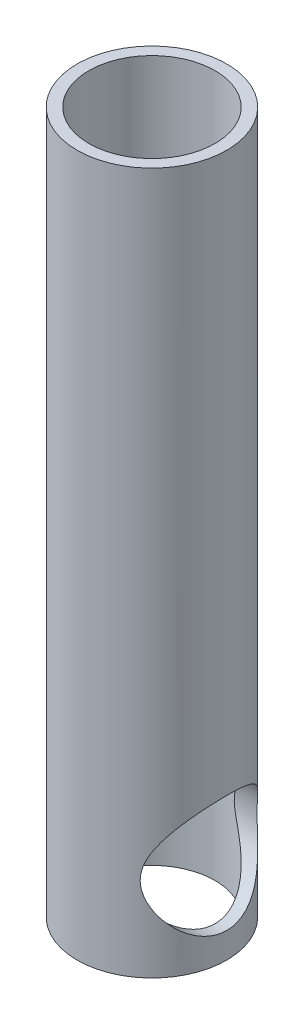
ISO-10303-21;
HEADER;
FILE_DESCRIPTION(('STEP AP214'),'2;1');
FILE_NAME('part.step','',(''),(''),'','','');
FILE_SCHEMA(('AUTOMOTIVE_DESIGN { 1 0 10303 214 1 1 1 1 }'));
ENDSEC;
DATA;
#1=APPLICATION_CONTEXT('core data for automotive mechanical design processes');
#2=APPLICATION_PROTOCOL_DEFINITION('international standard','automotive_design',2000,#1);
#3=PRODUCT_CONTEXT('',#1,'mechanical');
#4=PRODUCT('Part','Part','',(#3));
#5=PRODUCT_RELATED_PRODUCT_CATEGORY('part','',(#4));
#6=PRODUCT_DEFINITION_FORMATION('','',#4);
#7=PRODUCT_DEFINITION_CONTEXT('part definition',#1,'design');
#8=PRODUCT_DEFINITION('design','',#6,#7);
#9=PRODUCT_DEFINITION_SHAPE('','',#8);
#10=(LENGTH_UNIT() NAMED_UNIT(*) SI_UNIT(.MILLI.,.METRE.));
#11=(NAMED_UNIT(*) PLANE_ANGLE_UNIT() SI_UNIT($,.RADIAN.));
#12=(NAMED_UNIT(*) SI_UNIT($,.STERADIAN.) SOLID_ANGLE_UNIT());
#13=UNCERTAINTY_MEASURE_WITH_UNIT(LENGTH_MEASURE(1.E-05),#10,'distance_accuracy_value','');
#14=(GEOMETRIC_REPRESENTATION_CONTEXT(3) GLOBAL_UNCERTAINTY_ASSIGNED_CONTEXT((#13)) GLOBAL_UNIT_ASSIGNED_CONTEXT((#10,
#11,#12)) REPRESENTATION_CONTEXT('',''));
#15=CARTESIAN_POINT('',(0.,0.,0.));
#16=DIRECTION('',(0.,0.,1.));
#17=DIRECTION('',(1.,0.,0.));
#18=AXIS2_PLACEMENT_3D('',#15,#16,#17);
#19=CARTESIAN_POINT('',(0.,-150.,0.));
#20=DIRECTION('',(0.,1.,0.));
#21=DIRECTION('',(0.,0.,1.));
#22=AXIS2_PLACEMENT_3D('',#19,#20,#21);
#23=CYLINDRICAL_SURFACE('',#22,16.);
#24=CARTESIAN_POINT('',(0.,-150.,0.));
#25=DIRECTION('',(0.,1.,0.));
#26=DIRECTION('',(0.,0.,1.));
#27=AXIS2_PLACEMENT_3D('',#24,#25,#26);
#28=CIRCLE('',#27,16.);
#29=CARTESIAN_POINT('',(0.,-150.,16.));
#30=VERTEX_POINT('',#29);
#31=EDGE_CURVE('E10',#30,#30,#28,.T.);
#32=ORIENTED_EDGE('',*,*,#31,.T.);
#33=EDGE_LOOP('',(#32));
#34=FACE_BOUND('',#33,.T.);
#35=CARTESIAN_POINT('',(0.,0.,0.));
#36=DIRECTION('',(0.,1.,0.));
#37=DIRECTION('',(0.,0.,1.));
#38=AXIS2_PLACEMENT_3D('',#35,#36,#37);
#39=CIRCLE('',#38,16.);
#40=CARTESIAN_POINT('',(0.,0.,16.));
#41=VERTEX_POINT('',#40);
#42=EDGE_CURVE('E42',#41,#41,#39,.T.);
#43=ORIENTED_EDGE('',*,*,#42,.F.);
#44=EDGE_LOOP('',(#43));
#45=FACE_BOUND('',#44,.T.);
#46=CARTESIAN_POINT('',(16.,-119.5,0.));
#47=CARTESIAN_POINT('',(15.9999974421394,-119.500002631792,-0.302086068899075));
#48=CARTESIAN_POINT('',(15.9914249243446,-119.510970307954,-0.604225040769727));
#49=CARTESIAN_POINT('',(15.9573271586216,-119.554660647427,-1.20608996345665));
#50=CARTESIAN_POINT('',(15.9317926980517,-119.587395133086,-1.50581451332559));
#51=CARTESIAN_POINT('',(15.8643023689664,-119.674139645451,-2.10089296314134));
#52=CARTESIAN_POINT('',(15.8223143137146,-119.728191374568,-2.39623711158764));
#53=CARTESIAN_POINT('',(15.7228737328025,-119.856672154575,-2.97973825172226));
#54=CARTESIAN_POINT('',(15.6654229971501,-119.931098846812,-3.2678960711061));
#55=CARTESIAN_POINT('',(15.5366783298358,-120.098687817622,-3.83343309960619));
#56=CARTESIAN_POINT('',(15.4654741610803,-120.191728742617,-4.11086890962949));
#57=CARTESIAN_POINT('',(15.3103629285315,-120.395621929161,-4.65542172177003));
#58=CARTESIAN_POINT('',(15.2264557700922,-120.506474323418,-4.9225386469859));
#59=CARTESIAN_POINT('',(15.0474333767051,-120.744715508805,-5.44527867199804));
#60=CARTESIAN_POINT('',(14.9523210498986,-120.872100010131,-5.70090473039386));
#61=CARTESIAN_POINT('',(14.7523804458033,-121.142238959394,-6.1999653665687));
#62=CARTESIAN_POINT('',(14.6475502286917,-121.284996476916,-6.44339749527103));
#63=CARTESIAN_POINT('',(14.3930630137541,-121.635192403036,-6.99722949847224));
#64=CARTESIAN_POINT('',(14.2401860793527,-121.848238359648,-7.30262182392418));
#65=CARTESIAN_POINT('',(13.9234599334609,-122.297518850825,-7.88977901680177));
#66=CARTESIAN_POINT('',(13.7596073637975,-122.533760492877,-8.17153659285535));
#67=CARTESIAN_POINT('',(13.4241869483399,-123.028271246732,-8.71163039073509));
#68=CARTESIAN_POINT('',(13.2525998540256,-123.286596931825,-8.96990273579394));
#69=CARTESIAN_POINT('',(12.9059644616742,-123.823450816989,-9.46185010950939));
#70=CARTESIAN_POINT('',(12.7309165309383,-124.101976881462,-9.69552773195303));
#71=CARTESIAN_POINT('',(12.3790090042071,-124.682623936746,-10.1410963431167));
#72=CARTESIAN_POINT('',(12.2021587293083,-124.985022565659,-10.3526330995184));
#73=CARTESIAN_POINT('',(11.8540133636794,-125.609776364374,-10.7495133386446));
#74=CARTESIAN_POINT('',(11.6827199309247,-125.93213740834,-10.9348490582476));
#75=CARTESIAN_POINT('',(11.3521696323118,-126.595890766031,-11.2776218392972));
#76=CARTESIAN_POINT('',(11.1928794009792,-126.937225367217,-11.4351380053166));
#77=CARTESIAN_POINT('',(10.8931680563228,-127.639744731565,-11.7209952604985));
#78=CARTESIAN_POINT('',(10.7527312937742,-128.000912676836,-11.849360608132));
#79=CARTESIAN_POINT('',(10.551313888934,-128.59080284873,-12.0282936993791));
#80=CARTESIAN_POINT('',(10.4813139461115,-128.813343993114,-12.0892184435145));
#81=CARTESIAN_POINT('',(10.3530468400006,-129.264613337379,-12.1992440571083));
#82=CARTESIAN_POINT('',(10.2947754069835,-129.49333925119,-12.2483492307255));
#83=CARTESIAN_POINT('',(10.1920680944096,-129.95575348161,-12.3339460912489));
#84=CARTESIAN_POINT('',(10.1476057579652,-130.189431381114,-12.3704619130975));
#85=CARTESIAN_POINT('',(10.0741736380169,-130.66090801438,-12.4303372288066));
#86=CARTESIAN_POINT('',(10.0452037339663,-130.898706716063,-12.4536968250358));
#87=CARTESIAN_POINT('',(10.0039386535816,-131.378472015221,-12.4868703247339));
#88=CARTESIAN_POINT('',(9.99176706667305,-131.62045637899,-12.4965838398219));
#89=CARTESIAN_POINT('',(9.98510641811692,-132.104818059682,-12.5019066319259));
#90=CARTESIAN_POINT('',(9.99061674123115,-132.347195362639,-12.4975163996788));
#91=CARTESIAN_POINT('',(10.0190535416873,-132.830473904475,-12.4747300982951));
#92=CARTESIAN_POINT('',(10.0419960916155,-133.071373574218,-12.4563211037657));
#93=CARTESIAN_POINT('',(10.1042078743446,-133.549606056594,-12.4059085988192));
#94=CARTESIAN_POINT('',(10.1434794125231,-133.786938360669,-12.3739031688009));
#95=CARTESIAN_POINT('',(10.2452810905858,-134.300036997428,-12.2898063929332));
#96=CARTESIAN_POINT('',(10.3107710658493,-134.574784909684,-12.2350935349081));
#97=CARTESIAN_POINT('',(10.4589220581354,-135.115571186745,-12.1086910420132));
#98=CARTESIAN_POINT('',(10.5415871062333,-135.381607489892,-12.0369974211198));
#99=CARTESIAN_POINT('',(10.7208314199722,-135.904711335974,-11.8776332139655));
#100=CARTESIAN_POINT('',(10.8174423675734,-136.161756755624,-11.7899261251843));
#101=CARTESIAN_POINT('',(11.0212329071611,-136.665912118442,-11.599649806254));
#102=CARTESIAN_POINT('',(11.1284132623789,-136.913021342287,-11.4970795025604));
#103=CARTESIAN_POINT('',(11.3987704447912,-137.502487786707,-11.2302284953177));
#104=CARTESIAN_POINT('',(11.5660511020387,-137.839604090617,-11.0584930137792));
#105=CARTESIAN_POINT('',(11.9096322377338,-138.493591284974,-10.6875938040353));
#106=CARTESIAN_POINT('',(12.0859363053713,-138.810454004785,-10.4884191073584));
#107=CARTESIAN_POINT('',(12.4421021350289,-139.42417523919,-10.063352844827));
#108=CARTESIAN_POINT('',(12.6219673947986,-139.721012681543,-9.83743380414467));
#109=CARTESIAN_POINT('',(12.980266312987,-140.293804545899,-9.35958755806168));
#110=CARTESIAN_POINT('',(13.1587001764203,-140.569762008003,-9.10766415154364));
#111=CARTESIAN_POINT('',(13.5130080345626,-141.104513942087,-8.57339953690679));
#112=CARTESIAN_POINT('',(13.6887804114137,-141.362916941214,-8.29059787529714));
#113=CARTESIAN_POINT('',(14.0302038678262,-141.85535794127,-7.69870825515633));
#114=CARTESIAN_POINT('',(14.1958535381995,-142.08939255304,-7.38961665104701));
#115=CARTESIAN_POINT('',(14.5124245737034,-142.530142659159,-6.7466759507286));
#116=CARTESIAN_POINT('',(14.6633800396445,-142.736921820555,-6.41288750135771));
#117=CARTESIAN_POINT('',(14.9467751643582,-143.120829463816,-5.72130834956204));
#118=CARTESIAN_POINT('',(15.0792236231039,-143.297972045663,-5.36352917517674));
#119=CARTESIAN_POINT('',(15.2858273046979,-143.572036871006,-4.73482020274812));
#120=CARTESIAN_POINT('',(15.3656653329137,-143.677223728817,-4.46932634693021));
#121=CARTESIAN_POINT('',(15.5127047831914,-143.870042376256,-3.92866502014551));
#122=CARTESIAN_POINT('',(15.5799093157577,-143.957678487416,-3.65349995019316));
#123=CARTESIAN_POINT('',(15.7003868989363,-144.114233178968,-3.09506054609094));
#124=CARTESIAN_POINT('',(15.7536672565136,-144.183161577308,-2.81179055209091));
#125=CARTESIAN_POINT('',(15.8452544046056,-144.30136108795,-2.23876880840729));
#126=CARTESIAN_POINT('',(15.8835607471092,-144.350631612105,-1.94901686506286));
#127=CARTESIAN_POINT('',(15.9444882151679,-144.428890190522,-1.36388227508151));
#128=CARTESIAN_POINT('',(15.9670424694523,-144.457791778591,-1.06848102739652));
#129=CARTESIAN_POINT('',(15.9956844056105,-144.494480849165,-0.4755690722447));
#130=CARTESIAN_POINT('',(16.0017721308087,-144.502268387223,-0.178058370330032));
#131=CARTESIAN_POINT('',(15.9973385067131,-144.4965932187,0.416634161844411));
#132=CARTESIAN_POINT('',(15.9868171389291,-144.483130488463,0.7138159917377));
#133=CARTESIAN_POINT('',(15.9494108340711,-144.435189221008,1.30542714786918));
#134=CARTESIAN_POINT('',(15.9225264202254,-144.400711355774,1.59985656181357));
#135=CARTESIAN_POINT('',(15.8552267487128,-144.314174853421,2.16508039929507));
#136=CARTESIAN_POINT('',(15.8157824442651,-144.26337594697,2.43618570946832));
#137=CARTESIAN_POINT('',(15.7238448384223,-144.14457540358,2.97231786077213));
#138=CARTESIAN_POINT('',(15.6713522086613,-144.076574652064,3.23734501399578));
#139=CARTESIAN_POINT('',(15.5542574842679,-143.924231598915,3.75989010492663));
#140=CARTESIAN_POINT('',(15.4896557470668,-143.839889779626,4.01740826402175));
#141=CARTESIAN_POINT('',(15.3493899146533,-143.655785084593,4.52385994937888));
#142=CARTESIAN_POINT('',(15.2737217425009,-143.556016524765,4.772790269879));
#143=CARTESIAN_POINT('',(15.1060216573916,-143.333475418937,5.28064775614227));
#144=CARTESIAN_POINT('',(15.0131638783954,-143.209499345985,5.53877415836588));
#145=CARTESIAN_POINT('',(14.8173822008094,-142.945894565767,6.04304437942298));
#146=CARTESIAN_POINT('',(14.7144541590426,-142.806259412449,6.28918320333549));
#147=CARTESIAN_POINT('',(14.5000855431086,-142.51249594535,6.76879022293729));
#148=CARTESIAN_POINT('',(14.3886441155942,-142.358366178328,7.00225714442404));
#149=CARTESIAN_POINT('',(14.1587826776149,-142.036622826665,7.45611148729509));
#150=CARTESIAN_POINT('',(14.04036173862,-141.869007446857,7.67649716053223));
#151=CARTESIAN_POINT('',(13.7744264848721,-141.487207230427,8.14563443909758));
#152=CARTESIAN_POINT('',(13.62574479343,-141.270318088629,8.39152755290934));
#153=CARTESIAN_POINT('',(13.3232439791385,-140.819679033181,8.86396444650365));
#154=CARTESIAN_POINT('',(13.1694240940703,-140.585926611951,9.0905053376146));
#155=CARTESIAN_POINT('',(12.8592187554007,-140.102100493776,9.52426706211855));
#156=CARTESIAN_POINT('',(12.70283037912,-139.852007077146,9.73146379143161));
#157=CARTESIAN_POINT('',(12.3906616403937,-139.336256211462,10.1259443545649));
#158=CARTESIAN_POINT('',(12.2348812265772,-139.070600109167,10.3132299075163));
#159=CARTESIAN_POINT('',(11.935228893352,-138.538013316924,10.6583204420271));
#160=CARTESIAN_POINT('',(11.7911576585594,-138.271858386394,10.8171489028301));
#161=CARTESIAN_POINT('',(11.5098881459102,-137.725588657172,11.1159599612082));
#162=CARTESIAN_POINT('',(11.3726907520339,-137.445472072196,11.2559401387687));
#163=CARTESIAN_POINT('',(11.1093891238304,-136.871693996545,11.5158864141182));
#164=CARTESIAN_POINT('',(10.9832667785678,-136.578055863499,11.6358854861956));
#165=CARTESIAN_POINT('',(10.7466265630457,-135.976958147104,11.8547878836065));
#166=CARTESIAN_POINT('',(10.6361015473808,-135.669504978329,11.9537008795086));
#167=CARTESIAN_POINT('',(10.4661194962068,-135.13576694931,12.1024383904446));
#168=CARTESIAN_POINT('',(10.4012900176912,-134.912807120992,12.1580868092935));
#169=CARTESIAN_POINT('',(10.2839428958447,-134.461098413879,12.2575053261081));
#170=CARTESIAN_POINT('',(10.2314213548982,-134.232351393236,12.3012791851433));
#171=CARTESIAN_POINT('',(10.1406676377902,-133.770398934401,12.3762002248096));
#172=CARTESIAN_POINT('',(10.102410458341,-133.537202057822,12.4073695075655));
#173=CARTESIAN_POINT('',(10.0416649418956,-133.067365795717,12.4565848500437));
#174=CARTESIAN_POINT('',(10.0191763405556,-132.830726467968,12.4746311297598));
#175=CARTESIAN_POINT('',(9.99093601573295,-132.354430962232,12.4972611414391));
#176=CARTESIAN_POINT('',(9.98528078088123,-132.114765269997,12.5017672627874));
#177=CARTESIAN_POINT('',(9.99126095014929,-131.635796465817,12.4969883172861));
#178=CARTESIAN_POINT('',(10.002896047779,-131.396493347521,12.4877034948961));
#179=CARTESIAN_POINT('',(10.0429097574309,-130.919959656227,12.4555454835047));
#180=CARTESIAN_POINT('',(10.0713071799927,-130.682731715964,12.4326570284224));
#181=CARTESIAN_POINT('',(10.1435590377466,-130.212301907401,12.3737772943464));
#182=CARTESIAN_POINT('',(10.1874157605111,-129.979100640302,12.3377840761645));
#183=CARTESIAN_POINT('',(10.3007314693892,-129.463820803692,12.2434295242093));
#184=CARTESIAN_POINT('',(10.3737847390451,-129.18313143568,12.1817996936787));
#185=CARTESIAN_POINT('',(10.536993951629,-128.6313479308,12.0409031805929));
#186=CARTESIAN_POINT('',(10.6271547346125,-128.360256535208,11.9616315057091));
#187=CARTESIAN_POINT('',(10.8210769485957,-127.827788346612,11.7864917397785));
#188=CARTESIAN_POINT('',(10.9248693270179,-127.566435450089,11.6905857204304));
#189=CARTESIAN_POINT('',(11.1425295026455,-127.054327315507,11.4833200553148));
#190=CARTESIAN_POINT('',(11.2563978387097,-126.803572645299,11.3719595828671));
#191=CARTESIAN_POINT('',(11.5398129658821,-126.211199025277,11.0854996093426));
#192=CARTESIAN_POINT('',(11.7129343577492,-125.874818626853,10.9030692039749));
#193=CARTESIAN_POINT('',(12.0666581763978,-125.222893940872,10.5102672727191));
#194=CARTESIAN_POINT('',(12.2472633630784,-124.907357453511,10.2998853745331));
#195=CARTESIAN_POINT('',(12.6105219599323,-124.297052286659,9.85180212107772));
#196=CARTESIAN_POINT('',(12.7931770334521,-124.002302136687,9.61407687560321));
#197=CARTESIAN_POINT('',(13.155547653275,-123.434596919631,9.11193944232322));
#198=CARTESIAN_POINT('',(13.3352636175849,-123.161638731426,8.8475310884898));
#199=CARTESIAN_POINT('',(13.6894980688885,-122.635676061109,8.28904590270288));
#200=CARTESIAN_POINT('',(13.8639301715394,-122.382945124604,7.9946557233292));
#201=CARTESIAN_POINT('',(14.2010260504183,-121.903055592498,7.37929081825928));
#202=CARTESIAN_POINT('',(14.3636880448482,-121.675900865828,7.05831208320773));
#203=CARTESIAN_POINT('',(14.6725497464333,-121.250345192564,6.39147957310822));
#204=CARTESIAN_POINT('',(14.8187850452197,-121.051881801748,6.04568234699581));
#205=CARTESIAN_POINT('',(15.0908440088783,-120.686359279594,5.33034903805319));
#206=CARTESIAN_POINT('',(15.2166792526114,-120.519282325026,4.96082658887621));
#207=CARTESIAN_POINT('',(15.4082863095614,-120.266724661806,4.31962346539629));
#208=CARTESIAN_POINT('',(15.480539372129,-120.17206120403,4.05345323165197));
#209=CARTESIAN_POINT('',(15.6121821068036,-120.000279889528,3.51243541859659));
#210=CARTESIAN_POINT('',(15.6715750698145,-119.923157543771,3.23759007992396));
#211=CARTESIAN_POINT('',(15.7762574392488,-119.787623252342,2.68134823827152));
#212=CARTESIAN_POINT('',(15.8215776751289,-119.729170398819,2.39996752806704));
#213=CARTESIAN_POINT('',(15.8973523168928,-119.631622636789,1.83199185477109));
#214=CARTESIAN_POINT('',(15.9278135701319,-119.592518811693,1.54539935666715));
#215=CARTESIAN_POINT('',(15.9669562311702,-119.542317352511,1.04883130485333));
#216=CARTESIAN_POINT('',(15.9793326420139,-119.526463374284,0.8396102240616));
#217=CARTESIAN_POINT('',(15.9958562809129,-119.505302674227,0.420268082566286));
#218=CARTESIAN_POINT('',(16.0000017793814,-119.499998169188,0.21014684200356));
#219=CARTESIAN_POINT('',(16.,-119.5,0.));
#220=B_SPLINE_CURVE_WITH_KNOTS('',3,(#46,#47,#48,#49,#50,#51,#52,#53,#54,#55,#56,#57,#58,#59,
#60,#61,#62,#63,#64,#65,#66,#67,#68,#69,#70,#71,#72,#73,#74,#75,#76,#77,#78,#79,#80,#81,#82,#83,
#84,#85,#86,#87,#88,#89,#90,#91,#92,#93,#94,#95,#96,#97,#98,#99,#100,#101,#102,#103,#104,#105,
#106,#107,#108,#109,#110,#111,#112,#113,#114,#115,#116,#117,#118,#119,#120,#121,#122,#123,#124,
#125,#126,#127,#128,#129,#130,#131,#132,#133,#134,#135,#136,#137,#138,#139,#140,#141,#142,#143,
#144,#145,#146,#147,#148,#149,#150,#151,#152,#153,#154,#155,#156,#157,#158,#159,#160,#161,#162,
#163,#164,#165,#166,#167,#168,#169,#170,#171,#172,#173,#174,#175,#176,#177,#178,#179,#180,#181,
#182,#183,#184,#185,#186,#187,#188,#189,#190,#191,#192,#193,#194,#195,#196,#197,#198,#199,#200,
#201,#202,#203,#204,#205,#206,#207,#208,#209,#210,#211,#212,#213,#214,#215,#216,#217,#218,#219),
.UNSPECIFIED.,.T.,.F.,(4,2,2,2,2,2,2,2,2,2,2,2,2,2,2,2,2,2,2,2,2,2,2,2,2,2,2,2,2,2,2,2,2,2,2,2,
2,2,2,2,2,2,2,2,2,2,2,2,2,2,2,2,2,2,2,2,2,2,2,2,2,2,2,2,2,2,2,2,2,2,2,2,2,2,2,2,2,2,2,2,2,2,2,2,
2,2,4),(0.,0.90603250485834,1.81255751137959,2.72086479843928,3.62906698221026,4.53153062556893,
5.4340009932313,6.33623765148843,7.23865479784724,8.44452862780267,9.65077311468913,
10.8602059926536,12.069511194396,13.2958924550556,14.5226363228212,15.7458337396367,
16.9680094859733,17.6908043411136,18.4133355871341,19.1344738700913,19.8556065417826,
20.582016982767,21.3084021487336,22.0354578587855,22.762616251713,23.624387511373,
24.4863612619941,25.3503249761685,26.2143511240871,27.4536111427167,28.693367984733,
29.9344096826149,31.1752703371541,32.4381510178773,33.7012071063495,34.9612584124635,
36.2207085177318,37.1094254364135,37.9979232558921,38.8859538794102,39.7740110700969,
40.6658157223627,41.5576180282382,42.4494213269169,43.3411961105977,44.1761674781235,
45.0110958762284,45.8459996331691,46.6812117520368,47.5834463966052,48.4860538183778,
49.3887518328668,50.2915702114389,51.3705898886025,52.4497703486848,53.5302780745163,
54.610692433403,55.6352571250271,56.6599532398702,57.6829411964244,58.7054589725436,
59.4211745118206,60.1366630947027,60.8508915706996,61.5651080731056,62.2834106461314,
63.0017004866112,63.7207979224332,64.4400018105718,65.3281810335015,66.2166119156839,
67.1070958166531,67.9976273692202,69.2559065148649,70.5146538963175,71.7745095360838,
73.034184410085,74.3087275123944,75.5834631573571,76.8553812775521,78.126574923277,
79.0005222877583,79.8742457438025,80.7460413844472,81.6174349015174,82.2475860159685,
82.8778695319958),.UNSPECIFIED.);
#221=CARTESIAN_POINT('',(16.,-119.5,0.));
#222=VERTEX_POINT('',#221);
#223=EDGE_CURVE('E52',#222,#222,#220,.T.);
#224=ORIENTED_EDGE('',*,*,#223,.T.);
#225=EDGE_LOOP('',(#224));
#226=FACE_BOUND('',#225,.T.);
#227=ADVANCED_FACE('F30',(#34,#45,#226),#23,.T.);
#228=CARTESIAN_POINT('',(0.,-150.,0.));
#229=DIRECTION('',(0.,1.,0.));
#230=DIRECTION('',(0.,0.,1.));
#231=AXIS2_PLACEMENT_3D('',#228,#229,#230);
#232=CYLINDRICAL_SURFACE('',#231,13.5);
#233=CARTESIAN_POINT('',(0.,-150.,0.));
#234=DIRECTION('',(0.,1.,0.));
#235=DIRECTION('',(0.,0.,1.));
#236=AXIS2_PLACEMENT_3D('',#233,#234,#235);
#237=CIRCLE('',#236,13.5);
#238=CARTESIAN_POINT('',(0.,-150.,13.5));
#239=VERTEX_POINT('',#238);
#240=EDGE_CURVE('E47',#239,#239,#237,.T.);
#241=ORIENTED_EDGE('',*,*,#240,.F.);
#242=EDGE_LOOP('',(#241));
#243=FACE_BOUND('',#242,.T.);
#244=CARTESIAN_POINT('',(0.,0.,0.));
#245=DIRECTION('',(0.,1.,0.));
#246=DIRECTION('',(0.,0.,1.));
#247=AXIS2_PLACEMENT_3D('',#244,#245,#246);
#248=CIRCLE('',#247,13.5);
#249=CARTESIAN_POINT('',(0.,0.,13.5));
#250=VERTEX_POINT('',#249);
#251=EDGE_CURVE('E49',#250,#250,#248,.T.);
#252=ORIENTED_EDGE('',*,*,#251,.T.);
#253=EDGE_LOOP('',(#252));
#254=FACE_BOUND('',#253,.T.);
#255=CARTESIAN_POINT('',(5.09901951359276,-132.,12.5));
#256=CARTESIAN_POINT('',(5.09902766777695,-131.828804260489,12.4999980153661));
#257=CARTESIAN_POINT('',(5.10770534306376,-131.657524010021,12.4964677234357));
#258=CARTESIAN_POINT('',(5.14177882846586,-131.316841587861,12.482484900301));
#259=CARTESIAN_POINT('',(5.16719043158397,-131.147441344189,12.4720258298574));
#260=CARTESIAN_POINT('',(5.23310646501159,-130.81143733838,12.444511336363));
#261=CARTESIAN_POINT('',(5.27367509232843,-130.644848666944,12.4274278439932));
#262=CARTESIAN_POINT('',(5.36757735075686,-130.316030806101,12.38715952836));
#263=CARTESIAN_POINT('',(5.4209188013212,-130.153804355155,12.3639709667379));
#264=CARTESIAN_POINT('',(5.56882154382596,-129.749782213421,12.2982817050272));
#265=CARTESIAN_POINT('',(5.67028740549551,-129.511131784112,12.2520449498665));
#266=CARTESIAN_POINT('',(5.89008765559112,-129.044396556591,12.147908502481));
#267=CARTESIAN_POINT('',(6.00843553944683,-128.816320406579,12.0899994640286));
#268=CARTESIAN_POINT('',(6.25696908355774,-128.36897852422,11.9632716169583));
#269=CARTESIAN_POINT('',(6.38718960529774,-128.149741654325,11.8944202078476));
#270=CARTESIAN_POINT('',(6.6552894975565,-127.719682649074,11.7465133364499));
#271=CARTESIAN_POINT('',(6.79316729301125,-127.508858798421,11.6674599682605));
#272=CARTESIAN_POINT('',(7.06545141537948,-127.107037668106,11.5044795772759));
#273=CARTESIAN_POINT('',(7.19956989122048,-126.915609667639,11.4211293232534));
#274=CARTESIAN_POINT('',(7.47051350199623,-126.538711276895,11.2457772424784));
#275=CARTESIAN_POINT('',(7.60733901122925,-126.35324171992,11.1537742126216));
#276=CARTESIAN_POINT('',(8.0199965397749,-125.804945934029,10.8647276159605));
#277=CARTESIAN_POINT('',(8.29789352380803,-125.450399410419,10.6547146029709));
#278=CARTESIAN_POINT('',(8.85076100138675,-124.762782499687,10.2001085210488));
#279=CARTESIAN_POINT('',(9.12573465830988,-124.429686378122,9.95555805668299));
#280=CARTESIAN_POINT('',(9.66696659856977,-123.78533276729,9.43089029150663));
#281=CARTESIAN_POINT('',(9.93322967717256,-123.474063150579,9.15079298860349));
#282=CARTESIAN_POINT('',(10.3847212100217,-122.952642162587,8.63097268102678));
#283=CARTESIAN_POINT('',(10.5731604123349,-122.737092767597,8.39942690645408));
#284=CARTESIAN_POINT('',(10.9398568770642,-122.320628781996,7.91590597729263));
#285=CARTESIAN_POINT('',(11.1181142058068,-122.119714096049,7.66393095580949));
#286=CARTESIAN_POINT('',(11.461691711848,-121.734625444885,7.1398646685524));
#287=CARTESIAN_POINT('',(11.6270298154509,-121.550428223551,6.8678023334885));
#288=CARTESIAN_POINT('',(11.9423568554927,-121.200666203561,6.30353062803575));
#289=CARTESIAN_POINT('',(12.092349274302,-121.035097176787,6.01132585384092));
#290=CARTESIAN_POINT('',(12.3453505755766,-120.756765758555,5.46924230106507));
#291=CARTESIAN_POINT('',(12.4516986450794,-120.640124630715,5.22290761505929));
#292=CARTESIAN_POINT('',(12.6513754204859,-120.421603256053,4.71870555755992));
#293=CARTESIAN_POINT('',(12.7447070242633,-120.319719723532,4.46084076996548));
#294=CARTESIAN_POINT('',(12.916851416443,-120.132125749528,3.93465912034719));
#295=CARTESIAN_POINT('',(12.9956686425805,-120.046410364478,3.66634548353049));
#296=CARTESIAN_POINT('',(13.1373985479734,-119.892475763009,3.12061254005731));
#297=CARTESIAN_POINT('',(13.2003110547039,-119.82425673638,2.8431931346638));
#298=CARTESIAN_POINT('',(13.3093468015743,-119.706130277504,2.27911534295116));
#299=CARTESIAN_POINT('',(13.3553495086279,-119.656354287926,1.99240589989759));
#300=CARTESIAN_POINT('',(13.4289235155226,-119.576787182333,1.41387044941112));
#301=CARTESIAN_POINT('',(13.4564947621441,-119.546996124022,1.12204442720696));
#302=CARTESIAN_POINT('',(13.4925506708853,-119.508043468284,0.535951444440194));
#303=CARTESIAN_POINT('',(13.5010426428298,-119.498873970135,0.241685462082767));
#304=CARTESIAN_POINT('',(13.4987532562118,-119.501346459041,-0.346668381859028));
#305=CARTESIAN_POINT('',(13.4879735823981,-119.512986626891,-0.64075625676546));
#306=CARTESIAN_POINT('',(13.4496643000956,-119.554377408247,-1.19355945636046));
#307=CARTESIAN_POINT('',(13.4241255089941,-119.581975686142,-1.45257961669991));
#308=CARTESIAN_POINT('',(13.3585087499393,-119.652938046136,-1.96655801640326));
#309=CARTESIAN_POINT('',(13.3184320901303,-119.696300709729,-2.22151661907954));
#310=CARTESIAN_POINT('',(13.2244386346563,-119.798108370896,-2.72580727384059));
#311=CARTESIAN_POINT('',(13.1705208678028,-119.856554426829,-2.97513892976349));
#312=CARTESIAN_POINT('',(13.0497237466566,-119.987675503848,-3.46681514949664));
#313=CARTESIAN_POINT('',(12.9828436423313,-120.060351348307,-3.70915930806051));
#314=CARTESIAN_POINT('',(12.834287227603,-120.222055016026,-4.19500715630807));
#315=CARTESIAN_POINT('',(12.752137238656,-120.311608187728,-4.43819050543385));
#316=CARTESIAN_POINT('',(12.5760786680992,-120.503946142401,-4.91496292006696));
#317=CARTESIAN_POINT('',(12.4821655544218,-120.606736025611,-5.14854824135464));
#318=CARTESIAN_POINT('',(12.2838046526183,-120.824407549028,-5.60536824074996));
#319=CARTESIAN_POINT('',(12.1793565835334,-120.939289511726,-5.82860264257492));
#320=CARTESIAN_POINT('',(11.9610988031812,-121.180089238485,-6.26430493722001));
#321=CARTESIAN_POINT('',(11.8472870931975,-121.306009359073,-6.47677051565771));
#322=CARTESIAN_POINT('',(11.5495601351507,-121.636607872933,-6.99924978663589));
#323=CARTESIAN_POINT('',(11.3601867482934,-121.847952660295,-7.30197422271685));
#324=CARTESIAN_POINT('',(10.9660826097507,-122.290972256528,-7.88149364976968));
#325=CARTESIAN_POINT('',(10.7613449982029,-122.522656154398,-8.15827693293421));
#326=CARTESIAN_POINT('',(10.339502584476,-123.004505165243,-8.68672920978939));
#327=CARTESIAN_POINT('',(10.1223670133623,-123.254716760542,-8.93833103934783));
#328=CARTESIAN_POINT('',(9.67959989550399,-123.771247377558,-9.41601739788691));
#329=CARTESIAN_POINT('',(9.45396980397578,-124.037563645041,-9.64210627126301));
#330=CARTESIAN_POINT('',(8.99181603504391,-124.592106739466,-10.0747150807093));
#331=CARTESIAN_POINT('',(8.75516103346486,-124.880714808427,-10.2806047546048));
#332=CARTESIAN_POINT('',(8.28028425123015,-125.473538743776,-10.6667961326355));
#333=CARTESIAN_POINT('',(8.04206195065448,-125.77776004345,-10.8470888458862));
#334=CARTESIAN_POINT('',(7.56960920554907,-126.401737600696,-11.1818858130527));
#335=CARTESIAN_POINT('',(7.33537069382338,-126.721455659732,-11.3364496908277));
#336=CARTESIAN_POINT('',(6.87737928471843,-127.378935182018,-11.6199816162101));
#337=CARTESIAN_POINT('',(6.65361800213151,-127.716681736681,-11.7489704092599));
#338=CARTESIAN_POINT('',(6.25656585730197,-128.366611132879,-11.9644918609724));
#339=CARTESIAN_POINT('',(6.08056103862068,-128.675952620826,-12.0544204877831));
#340=CARTESIAN_POINT('',(5.8375512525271,-129.154707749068,-12.1729711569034));
#341=CARTESIAN_POINT('',(5.76004943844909,-129.31674520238,-12.2097635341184));
#342=CARTESIAN_POINT('',(5.6142043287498,-129.646028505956,-12.2775056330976));
#343=CARTESIAN_POINT('',(5.54585963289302,-129.813273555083,-12.3084562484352));
#344=CARTESIAN_POINT('',(5.38049726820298,-130.263028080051,-12.3819610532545));
#345=CARTESIAN_POINT('',(5.29338237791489,-130.550366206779,-12.4191405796));
#346=CARTESIAN_POINT('',(5.19617898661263,-130.989705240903,-12.4599740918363));
#347=CARTESIAN_POINT('',(5.16936541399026,-131.137399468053,-12.4710925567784));
#348=CARTESIAN_POINT('',(5.12814265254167,-131.434779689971,-12.4881006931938));
#349=CARTESIAN_POINT('',(5.11372690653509,-131.584464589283,-12.4939931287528));
#350=CARTESIAN_POINT('',(5.09806379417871,-131.88575193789,-12.5003928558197));
#351=CARTESIAN_POINT('',(5.09691432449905,-132.037360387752,-12.5008601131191));
#352=CARTESIAN_POINT('',(5.10810370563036,-132.339989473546,-12.4962918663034));
#353=CARTESIAN_POINT('',(5.1204428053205,-132.491010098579,-12.4912562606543));
#354=CARTESIAN_POINT('',(5.15791745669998,-132.791444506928,-12.4758282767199));
#355=CARTESIAN_POINT('',(5.18307730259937,-132.940854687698,-12.4654257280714));
#356=CARTESIAN_POINT('',(5.24488533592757,-133.236851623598,-12.4395455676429));
#357=CARTESIAN_POINT('',(5.28153838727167,-133.383437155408,-12.424065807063));
#358=CARTESIAN_POINT('',(5.38220764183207,-133.734075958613,-12.3808706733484));
#359=CARTESIAN_POINT('',(5.45124965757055,-133.93638671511,-12.3507472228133));
#360=CARTESIAN_POINT('',(5.60463717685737,-134.333582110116,-12.2819011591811));
#361=CARTESIAN_POINT('',(5.68899173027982,-134.528462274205,-12.2431734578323));
#362=CARTESIAN_POINT('',(5.86934657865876,-134.911683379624,-12.157744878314));
#363=CARTESIAN_POINT('',(5.96538388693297,-135.100000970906,-12.1110184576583));
#364=CARTESIAN_POINT('',(6.16584198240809,-135.470131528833,-12.0102037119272));
#365=CARTESIAN_POINT('',(6.27026605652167,-135.651941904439,-11.9561124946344));
#366=CARTESIAN_POINT('',(6.48888743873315,-136.015914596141,-11.838929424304));
#367=CARTESIAN_POINT('',(6.60329868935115,-136.197867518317,-11.7755892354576));
#368=CARTESIAN_POINT('',(6.83661944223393,-136.556068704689,-11.6416821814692));
#369=CARTESIAN_POINT('',(6.95552838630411,-136.73231767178,-11.5711162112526));
#370=CARTESIAN_POINT('',(7.31696025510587,-137.253676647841,-11.3486546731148));
#371=CARTESIAN_POINT('',(7.56402708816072,-137.591139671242,-11.1860798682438));
#372=CARTESIAN_POINT('',(8.06217782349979,-138.248551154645,-10.8325876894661));
#373=CARTESIAN_POINT('',(8.31326719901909,-138.568472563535,-10.6416281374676));
#374=CARTESIAN_POINT('',(8.81341404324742,-139.191004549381,-10.2312439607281));
#375=CARTESIAN_POINT('',(9.06247217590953,-139.493620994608,-10.0118290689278));
#376=CARTESIAN_POINT('',(9.57190907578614,-140.102541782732,-9.52686200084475));
#377=CARTESIAN_POINT('',(9.8317969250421,-140.407518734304,-9.25911670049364));
#378=CARTESIAN_POINT('',(10.3389656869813,-140.995344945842,-8.68915162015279));
#379=CARTESIAN_POINT('',(10.5862425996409,-141.278187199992,-8.38692099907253));
#380=CARTESIAN_POINT('',(11.0620049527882,-141.817535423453,-7.74854861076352));
#381=CARTESIAN_POINT('',(11.2905525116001,-142.074129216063,-7.4125279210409));
#382=CARTESIAN_POINT('',(11.7240432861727,-142.557681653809,-6.70584240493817));
#383=CARTESIAN_POINT('',(11.9290051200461,-142.784663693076,-6.33520532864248));
#384=CARTESIAN_POINT('',(12.235179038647,-143.122161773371,-5.71138345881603));
#385=CARTESIAN_POINT('',(12.3457257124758,-143.243626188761,-5.46862260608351));
#386=CARTESIAN_POINT('',(12.5542482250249,-143.472198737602,-4.9712671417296));
#387=CARTESIAN_POINT('',(12.6522280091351,-143.579311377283,-4.71667627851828));
#388=CARTESIAN_POINT('',(12.8340940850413,-143.777756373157,-4.19665004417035));
#389=CARTESIAN_POINT('',(12.917986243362,-143.869095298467,-3.93121924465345));
#390=CARTESIAN_POINT('',(13.0702710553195,-144.034660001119,-3.39069871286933));
#391=CARTESIAN_POINT('',(13.1386631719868,-144.10888518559,-3.11560864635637));
#392=CARTESIAN_POINT('',(13.2590538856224,-144.239409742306,-2.55541757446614));
#393=CARTESIAN_POINT('',(13.3109272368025,-144.295572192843,-2.27025748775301));
#394=CARTESIAN_POINT('',(13.3964578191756,-144.388115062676,-1.69403103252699));
#395=CARTESIAN_POINT('',(13.4301151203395,-144.424495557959,-1.40296468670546));
#396=CARTESIAN_POINT('',(13.4784219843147,-144.476696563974,-0.81753773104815));
#397=CARTESIAN_POINT('',(13.4930792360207,-144.49252539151,-0.523178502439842));
#398=CARTESIAN_POINT('',(13.503053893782,-144.503298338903,0.066236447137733));
#399=CARTESIAN_POINT('',(13.4983730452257,-144.498244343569,0.361292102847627));
#400=CARTESIAN_POINT('',(13.471344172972,-144.469047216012,0.91751901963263));
#401=CARTESIAN_POINT('',(13.4509623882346,-144.447028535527,1.17890252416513));
#402=CARTESIAN_POINT('',(13.3953110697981,-144.386867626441,1.69817957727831));
#403=CARTESIAN_POINT('',(13.3600428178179,-144.348726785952,1.95607342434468));
#404=CARTESIAN_POINT('',(13.2752542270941,-144.256944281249,2.46670300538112));
#405=CARTESIAN_POINT('',(13.2257331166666,-144.203301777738,2.71943845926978));
#406=CARTESIAN_POINT('',(13.1132764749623,-144.081331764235,3.21828616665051));
#407=CARTESIAN_POINT('',(13.0503402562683,-144.013003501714,3.4643980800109));
#408=CARTESIAN_POINT('',(12.9104145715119,-143.860848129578,3.9544457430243));
#409=CARTESIAN_POINT('',(12.8331310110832,-143.776696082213,4.19819616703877));
#410=CARTESIAN_POINT('',(12.6666447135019,-143.595051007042,4.67656794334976));
#411=CARTESIAN_POINT('',(12.5774374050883,-143.497552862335,4.91118574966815));
#412=CARTESIAN_POINT('',(12.3882854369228,-143.290323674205,5.3704815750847));
#413=CARTESIAN_POINT('',(12.288339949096,-143.180591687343,5.59515882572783));
#414=CARTESIAN_POINT('',(12.0788651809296,-142.949945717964,6.03408509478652));
#415=CARTESIAN_POINT('',(11.9693338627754,-142.82902935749,6.24833188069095));
#416=CARTESIAN_POINT('',(11.6840470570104,-142.513023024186,6.77211806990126));
#417=CARTESIAN_POINT('',(11.5028949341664,-142.311434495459,7.07483337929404));
#418=CARTESIAN_POINT('',(11.1249606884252,-141.888066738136,7.65541271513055));
#419=CARTESIAN_POINT('',(10.9281718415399,-141.66627881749,7.93326594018));
#420=CARTESIAN_POINT('',(10.5219183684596,-141.204502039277,8.46471047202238));
#421=CARTESIAN_POINT('',(10.3124275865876,-140.964475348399,8.71824873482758));
#422=CARTESIAN_POINT('',(9.88435438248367,-140.468539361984,9.20073555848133));
#423=CARTESIAN_POINT('',(9.6657732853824,-140.212632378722,9.42968768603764));
#424=CARTESIAN_POINT('',(9.21726395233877,-139.679790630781,9.86878270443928));
#425=CARTESIAN_POINT('',(8.98718923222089,-139.40249802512,10.0783403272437));
#426=CARTESIAN_POINT('',(8.52422651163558,-138.833009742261,10.472823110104));
#427=CARTESIAN_POINT('',(8.29133782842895,-138.540810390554,10.6577421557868));
#428=CARTESIAN_POINT('',(7.82733191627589,-137.941637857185,11.0030169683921));
#429=CARTESIAN_POINT('',(7.59621280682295,-137.634683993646,11.1634037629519));
#430=CARTESIAN_POINT('',(7.1410942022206,-137.004311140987,11.4598537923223));
#431=CARTESIAN_POINT('',(6.91709076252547,-136.680901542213,11.5959307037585));
#432=CARTESIAN_POINT('',(6.59147635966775,-136.178976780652,11.7821247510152));
#433=CARTESIAN_POINT('',(6.4839969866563,-136.007681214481,11.8415333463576));
#434=CARTESIAN_POINT('',(6.27476971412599,-135.659529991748,11.9537155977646));
#435=CARTESIAN_POINT('',(6.17302053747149,-135.482675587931,12.0064907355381));
#436=CARTESIAN_POINT('',(5.97740021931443,-135.122831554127,12.1050682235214));
#437=CARTESIAN_POINT('',(5.88352504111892,-134.939845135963,12.150874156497));
#438=CARTESIAN_POINT('',(5.70645620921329,-134.567210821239,12.2350302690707));
#439=CARTESIAN_POINT('',(5.62325891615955,-134.377565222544,12.2733829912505));
#440=CARTESIAN_POINT('',(5.43463726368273,-133.898427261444,12.3583957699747));
#441=CARTESIAN_POINT('',(5.33758765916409,-133.604524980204,12.4002686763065));
#442=CARTESIAN_POINT('',(5.22600198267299,-133.154214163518,12.4475115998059));
#443=CARTESIAN_POINT('',(5.19449184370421,-133.002751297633,12.4606573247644));
#444=CARTESIAN_POINT('',(5.14429135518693,-132.697377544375,12.4814669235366));
#445=CARTESIAN_POINT('',(5.12559090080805,-132.543468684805,12.4891351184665));
#446=CARTESIAN_POINT('',(5.10891279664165,-132.324300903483,12.4959605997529));
#447=CARTESIAN_POINT('',(5.105207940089,-132.259507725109,12.4974741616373));
#448=CARTESIAN_POINT('',(5.1002597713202,-132.12981374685,12.4994942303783));
#449=CARTESIAN_POINT('',(5.09901642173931,-132.064912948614,12.5000007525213));
#450=CARTESIAN_POINT('',(5.09901951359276,-132.,12.5));
#451=B_SPLINE_CURVE_WITH_KNOTS('',3,(#255,#256,#257,#258,#259,#260,#261,#262,#263,#264,#265,
#266,#267,#268,#269,#270,#271,#272,#273,#274,#275,#276,#277,#278,#279,#280,#281,#282,#283,#284,
#285,#286,#287,#288,#289,#290,#291,#292,#293,#294,#295,#296,#297,#298,#299,#300,#301,#302,#303,
#304,#305,#306,#307,#308,#309,#310,#311,#312,#313,#314,#315,#316,#317,#318,#319,#320,#321,#322,
#323,#324,#325,#326,#327,#328,#329,#330,#331,#332,#333,#334,#335,#336,#337,#338,#339,#340,#341,
#342,#343,#344,#345,#346,#347,#348,#349,#350,#351,#352,#353,#354,#355,#356,#357,#358,#359,#360,
#361,#362,#363,#364,#365,#366,#367,#368,#369,#370,#371,#372,#373,#374,#375,#376,#377,#378,#379,
#380,#381,#382,#383,#384,#385,#386,#387,#388,#389,#390,#391,#392,#393,#394,#395,#396,#397,#398,
#399,#400,#401,#402,#403,#404,#405,#406,#407,#408,#409,#410,#411,#412,#413,#414,#415,#416,#417,
#418,#419,#420,#421,#422,#423,#424,#425,#426,#427,#428,#429,#430,#431,#432,#433,#434,#435,#436,
#437,#438,#439,#440,#441,#442,#443,#444,#445,#446,#447,#448,#449,#450),.UNSPECIFIED.,.T.,.F.,(4,
2,2,2,2,2,2,2,2,2,2,2,2,2,2,2,2,2,2,2,2,2,2,2,2,2,2,2,2,2,2,2,2,2,2,2,2,2,2,2,2,2,2,2,2,2,2,2,2,
2,2,2,2,2,2,2,2,2,2,2,2,2,2,2,2,2,2,2,2,2,2,2,2,2,2,2,2,2,2,2,2,2,2,2,2,2,2,2,2,2,2,2,2,2,2,2,2,
4),(0.,0.513488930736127,1.02746317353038,1.54363947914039,2.06013259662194,2.84894894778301,
3.63839944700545,4.43024762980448,5.22193353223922,5.9661316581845,6.71043341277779,
8.19967779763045,9.68710087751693,11.1736908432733,12.2774637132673,13.3812293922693,
14.4834352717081,15.5853904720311,16.4622861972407,17.3389863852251,18.2154180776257,
19.091859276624,19.9744318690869,20.8570070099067,21.7392439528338,22.6214037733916,
23.4057010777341,24.1899278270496,24.9742096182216,25.758536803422,26.5733179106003,
27.3884139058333,28.2035316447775,29.0188238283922,30.2617621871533,31.5052588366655,
32.7519883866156,33.9985053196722,35.2761744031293,36.5542911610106,37.8294034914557,
39.1034772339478,40.2029188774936,40.7526089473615,41.3022148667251,42.2059814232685,
42.6570292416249,43.1078383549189,43.5619720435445,44.0161141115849,44.4711199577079,
44.9263186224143,45.572848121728,46.2197609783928,46.8687795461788,47.5180537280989,
48.1899996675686,48.861862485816,50.2065346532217,51.5532252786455,52.8994564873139,
54.343427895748,55.7878545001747,57.2272783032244,58.6655579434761,59.5441137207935,
60.4223929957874,61.3003056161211,62.1782486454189,63.0626979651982,63.947143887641,
64.8312317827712,65.7152398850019,66.5036053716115,67.2919029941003,68.0802433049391,
68.8686240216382,69.6754322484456,70.4825506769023,71.2897313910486,72.0970841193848,
73.314198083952,74.5318382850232,75.7520771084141,76.9721386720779,78.2215623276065,
79.4712954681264,80.7194346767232,81.9668694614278,82.5989736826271,83.2309364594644,
83.862573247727,84.4939941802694,85.4271245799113,85.8923986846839,86.3573053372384,
86.5520098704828,86.7467114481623),.UNSPECIFIED.);
#452=CARTESIAN_POINT('',(5.09901951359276,-132.,12.5));
#453=VERTEX_POINT('',#452);
#454=EDGE_CURVE('E34',#453,#453,#451,.T.);
#455=ORIENTED_EDGE('',*,*,#454,.F.);
#456=EDGE_LOOP('',(#455));
#457=FACE_BOUND('',#456,.T.);
#458=ADVANCED_FACE('F63',(#243,#254,#457),#232,.F.);
#459=CARTESIAN_POINT('',(0.,-150.,0.));
#460=DIRECTION('',(0.,1.,0.));
#461=DIRECTION('',(0.,0.,1.));
#462=AXIS2_PLACEMENT_3D('',#459,#460,#461);
#463=PLANE('',#462);
#464=ORIENTED_EDGE('',*,*,#240,.T.);
#465=EDGE_LOOP('',(#464));
#466=FACE_BOUND('',#465,.T.);
#467=ORIENTED_EDGE('',*,*,#31,.F.);
#468=EDGE_LOOP('',(#467));
#469=FACE_BOUND('',#468,.T.);
#470=ADVANCED_FACE('F68',(#466,#469),#463,.F.);
#471=CARTESIAN_POINT('',(0.,0.,0.));
#472=DIRECTION('',(0.,1.,0.));
#473=DIRECTION('',(0.,0.,1.));
#474=AXIS2_PLACEMENT_3D('',#471,#472,#473);
#475=PLANE('',#474);
#476=ORIENTED_EDGE('',*,*,#251,.F.);
#477=EDGE_LOOP('',(#476));
#478=FACE_BOUND('',#477,.T.);
#479=ORIENTED_EDGE('',*,*,#42,.T.);
#480=EDGE_LOOP('',(#479));
#481=FACE_BOUND('',#480,.T.);
#482=ADVANCED_FACE('F61',(#478,#481),#475,.T.);
#483=CARTESIAN_POINT('',(16.,-132.,0.));
#484=DIRECTION('',(-1.,0.,0.));
#485=DIRECTION('',(0.,0.,1.));
#486=AXIS2_PLACEMENT_3D('',#483,#484,#485);
#487=CYLINDRICAL_SURFACE('',#486,12.5);
#488=ORIENTED_EDGE('',*,*,#223,.F.);
#489=EDGE_LOOP('',(#488));
#490=FACE_BOUND('',#489,.T.);
#491=ORIENTED_EDGE('',*,*,#454,.T.);
#492=EDGE_LOOP('',(#491));
#493=FACE_BOUND('',#492,.T.);
#494=ADVANCED_FACE('F58',(#490,#493),#487,.F.);
#495=CLOSED_SHELL('',(#227,#458,#470,#482,#494));
#496=MANIFOLD_SOLID_BREP('B2',#495);
#497=ADVANCED_BREP_SHAPE_REPRESENTATION('',(#18,#496),#14);
#498=SHAPE_DEFINITION_REPRESENTATION(#9,#497);
ENDSEC;
END-ISO-10303-21;
